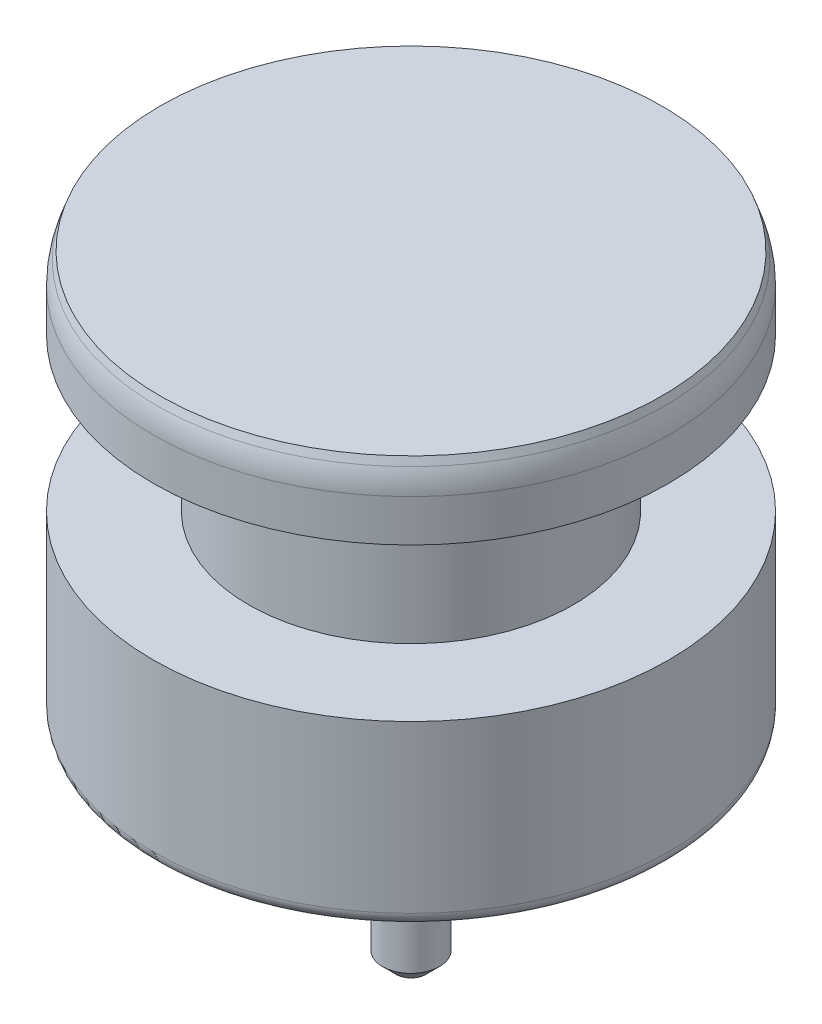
from build123d import *

# Parameters (mm, degrees)
FILLET1_R     = 0.2
FILLET2_R     = 1
CHAMFER1_SIZE = 0.2


with BuildPart() as part:
    # Sketch1 → Revolve1 (revolve)
    with BuildSketch(Plane.XY, mode=Mode.PRIVATE) as revolve1_sk:
        Polygon((0, 0), (0, -9.15), (0.42, -9.15), (0.42, -7.857512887), (3.81, -5.900295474), (3.81, -3.33), (2.4, -3.33), (2.4, -1.07), (3.81, -1.07), (3.81, -0.274747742), (3.71, 0), align=None)
    revolve(revolve1_sk.sketch.rotate(Axis((0, 0, 0), (0, -1, 0)), 180), axis=Axis((0, 0, 0), (0, -1, 0)))

    # Fillet1
    fillet1_edges = [part.edges().sort_by_distance(p)[0] for p in [
        (3.81, -5.900295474, 0),
    ]]
    fillet(fillet1_edges, radius=FILLET1_R)

    # Fillet2
    fillet2_edges = [part.edges().sort_by_distance(p)[0] for p in [
        (3.81, -0.274747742, 0),
    ]]
    fillet(fillet2_edges, radius=FILLET2_R)

    # Chamfer1
    chamfer1_edges = [part.edges().sort_by_distance(p)[0] for p in [
        (0.42, -9.15, 0),
    ]]
    chamfer(chamfer1_edges, length=CHAMFER1_SIZE)


solid = part.part
